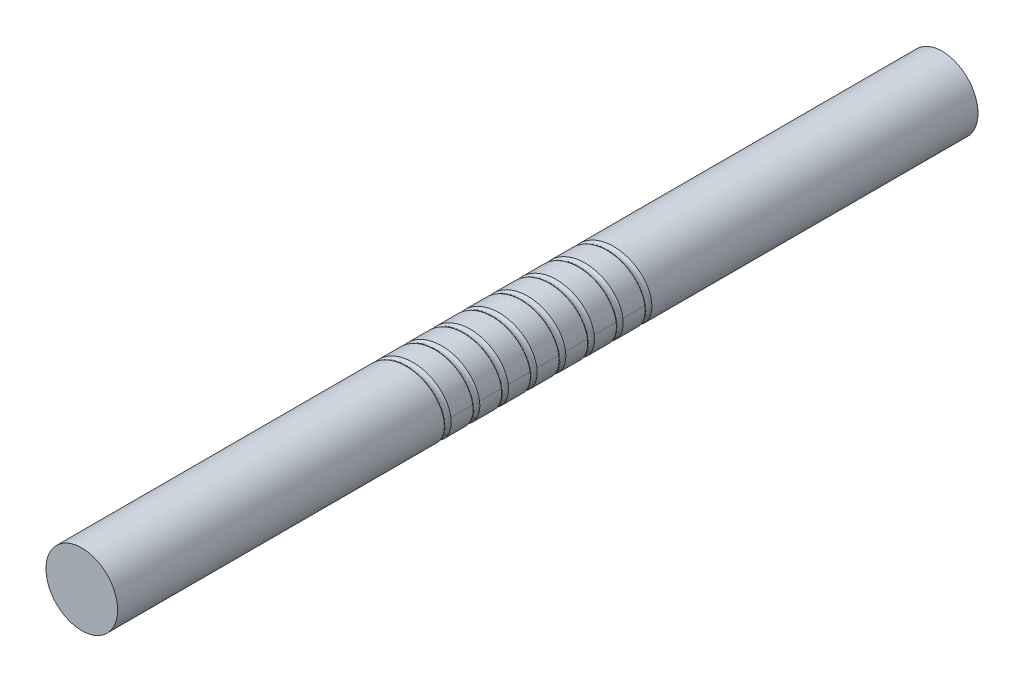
from build123d import *

# Parameters (mm, degrees)
SKETCH1_R              = 25
BOSS_EXTRUDE1_DEPTH    = 600
CUT_SWEEP1_PITCH       = 20
CUT_SWEEP1_HEIGHT      = 160
CUT_SWEEP1_RADIUS      = 27.116666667
CUT_SWEEP1_START_ANGLE = -180
SKETCH3_R              = 3.175


with BuildPart() as part:
    # Sketch1 → Boss-Extrude1 (new body)
    with BuildSketch(Plane.XY):
        Circle(SKETCH1_R)
    extrude(amount=BOSS_EXTRUDE1_DEPTH)

    # Cut-Sweep1: sweep along a helix
    with BuildLine() as cut_sweep1_path:
        add(Helix(CUT_SWEEP1_PITCH, CUT_SWEEP1_HEIGHT, CUT_SWEEP1_RADIUS, center=(0, 0, 220), direction=(0, 0, 1), mode=Mode.PRIVATE).rotate(Axis((0, 0, 220), (0, 0, 1)), CUT_SWEEP1_START_ANGLE))
    # Sketch3 → Cut-Sweep1 (sweep, cut)
    with BuildSketch(Plane(origin=(0, 0, 0), x_dir=(1, 0, 0), z_dir=(0, 1, 0))):
        with Locations((-27.116666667, -220)):
            Circle(SKETCH3_R)
    sweep(path=cut_sweep1_path.line, is_frenet=True, mode=Mode.SUBTRACT)


solid = part.part
